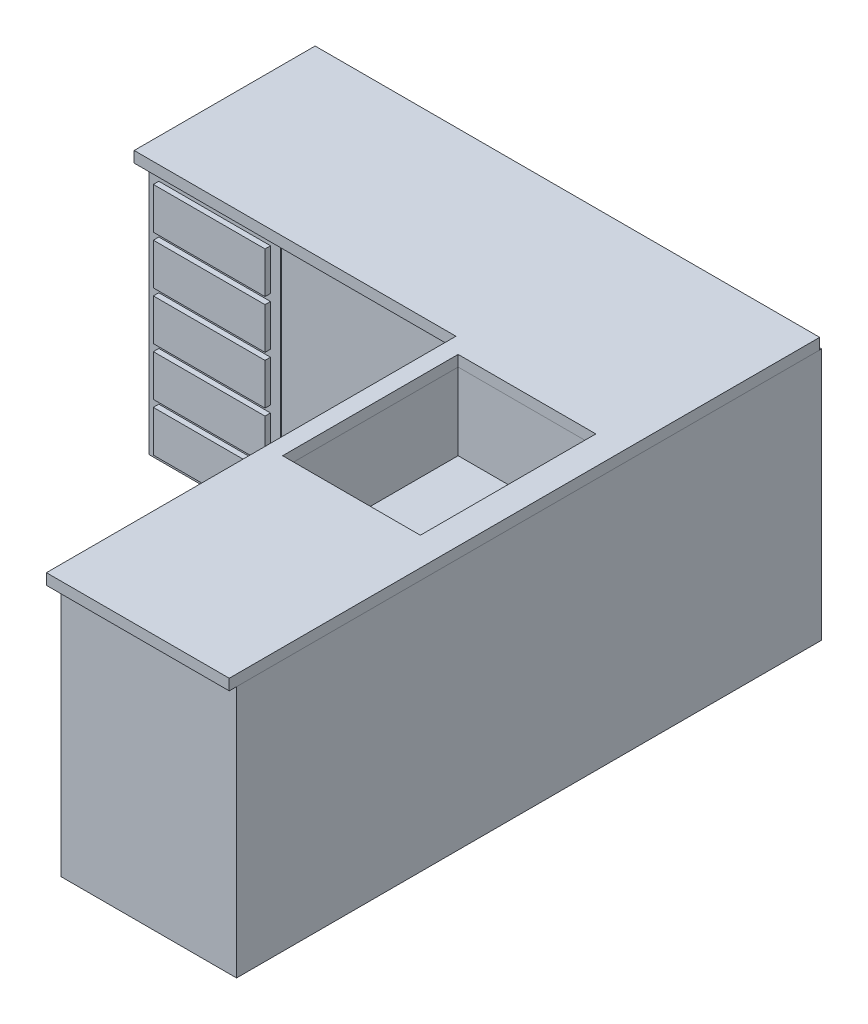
from build123d import *

# Parameters (mm, degrees)
SKETCH1_W           = 1727.2
SKETCH1_H           = 876.3
BOSS_EXTRUDE1_DEPTH = 609.6
SKETCH2_W           = 1752.6
SKETCH2_H           = 628.488095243
BOSS_EXTRUDE2_DEPTH = 38.1
SKETCH3_W           = 609.6
SKETCH3_H           = 876.3
BOSS_EXTRUDE3_DEPTH = 1422.4
SKETCH4_W           = 635
SKETCH4_H           = 38.1
BOSS_EXTRUDE4_DEPTH = 1422.4
SKETCH6_W           = 609.6
SKETCH6_H           = 876.3
CUT_EXTRUDE3_DEPTH  = 2433.17434408
SKETCH7_W           = 596.9
SKETCH7_H           = 876.3
BOSS_EXTRUDE5_DEPTH = 508
SKETCH8_W           = 387.942340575
SKETCH8_H           = 143.620327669
BOSS_EXTRUDE6_DEPTH = 19.05
LPATTERN1_COUNT     = 5
LPATTERN1_PITCH     = 167.64
SKETCH5_W           = 478.367232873
SKETCH5_H           = 609.6
CUT_EXTRUDE1_DEPTH  = 304.8
SKETCH10_W          = 607.335562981
SKETCH10_H          = 254.367596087
BOSS_EXTRUDE7_DEPTH = 19.05
LPATTERN2_COUNT     = 3
LPATTERN2_PITCH     = 266.7
SKETCH11_W          = 724.324329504
SKETCH11_H          = 154.907916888
SKETCH11_W_2        = 353.392571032
SKETCH11_H_2        = 648.685568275
BOSS_EXTRUDE8_DEPTH = 19.05


with BuildPart() as part:
    # Sketch1 → Boss-Extrude1 (new body)
    with BuildSketch(Plane.XY):
        with Locations((863.6, 438.15)):
            Rectangle(SKETCH1_W, SKETCH1_H)
    extrude(amount=-BOSS_EXTRUDE1_DEPTH)

    # Sketch3 → Boss-Extrude3 (add)
    with BuildSketch(Plane.XY):
        with Locations((1422.4, 438.15)):
            Rectangle(SKETCH3_W, SKETCH3_H)
    extrude(amount=BOSS_EXTRUDE3_DEPTH)

    # Sketch6 → Cut-Extrude3 (cut, through all)
    with BuildSketch(Plane.XY):
        with Locations((762, 438.15)):
            Rectangle(SKETCH6_W, SKETCH6_H)
    extrude(amount=-CUT_EXTRUDE3_DEPTH, mode=Mode.SUBTRACT)


with BuildPart() as body_2:
    # Sketch2 → Boss-Extrude2 (new body)
    with BuildSketch(Plane(origin=(0, 876.3, 0), x_dir=(1, 0, 0), z_dir=(0, 1, 0))):
        with Locations((850.9, 288.844047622)):
            Rectangle(SKETCH2_W, SKETCH2_H)
    extrude(amount=BOSS_EXTRUDE2_DEPTH)

    # Sketch4 → Boss-Extrude4 (add)
    with BuildSketch(Plane.XY.offset(25.4)):
        with Locations((1409.7, 895.35)):
            Rectangle(SKETCH4_W, SKETCH4_H)
    extrude(amount=BOSS_EXTRUDE4_DEPTH)


with BuildPart() as cut_extrude3_piece_1:
    # of the separate pieces the step leaves, piece 1, a body of its own (cut_extrude3_pieces)
    add(part.part.solids().sort_by_distance((1066.8, 0, 0))[0])


with BuildPart() as cut_extrude3_piece_2:
    # of the separate pieces the step leaves, piece 2, a body of its own (cut_extrude3_pieces)
    add(part.part.solids().sort_by_distance((0, 0, 0))[0])

    # Sketch8 → Boss-Extrude6 (add)
    with BuildSketch(Plane.XY):
        with Locations((228.754726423, 767.36730674)):
            Rectangle(SKETCH8_W, SKETCH8_H)
    boss_extrude6 = extrude(amount=BOSS_EXTRUDE6_DEPTH)

    # LPattern1: Boss-Extrude6 ×5
    with Locations(*[(0, -i * LPATTERN1_PITCH, 0) for i in range(1, LPATTERN1_COUNT)]):
        add(boss_extrude6)


with BuildPart() as body_4:
    # Sketch7 → Boss-Extrude5 (new body)
    with BuildSketch(Plane.XY):
        with Locations((758.825, 438.15)):
            Rectangle(SKETCH7_W, SKETCH7_H)
    extrude(amount=-BOSS_EXTRUDE5_DEPTH)


with BuildPart() as cut_extrude1_tool:
    # Sketch5 → Cut-Extrude1 (new body)
    with BuildSketch(Plane(origin=(0, 914.4, 0), x_dir=(1, 0, 0), z_dir=(0, 1, 0))):
        with Locations((1389.764581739, -381)):
            Rectangle(SKETCH5_W, SKETCH5_H)
    extrude(amount=-CUT_EXTRUDE1_DEPTH)


with BuildPart() as body_2_1:
    add(body_2.part)

    # Cut-Extrude1: cut by cut_extrude1_tool
    add(cut_extrude1_tool.part, mode=Mode.SUBTRACT)


with BuildPart() as cut_extrude3_piece_1_1:
    add(cut_extrude3_piece_1.part)

    # Cut-Extrude1: cut by cut_extrude1_tool
    add(cut_extrude1_tool.part, mode=Mode.SUBTRACT)

    # Sketch10 → Boss-Extrude7 (add)
    with BuildSketch(Plane.ZY.offset(-1117.6)):
        with Locations((1084.808374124, 706.600978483)):
            Rectangle(SKETCH10_W, SKETCH10_H)
    boss_extrude7 = extrude(amount=BOSS_EXTRUDE7_DEPTH)

    # LPattern2: Boss-Extrude7 ×3
    with Locations(*[(0, -i * LPATTERN2_PITCH, 0) for i in range(1, LPATTERN2_COUNT)]):
        add(boss_extrude7)

    # Sketch11 → Boss-Extrude8 (add)
    with BuildSketch(Plane.ZY.offset(-1117.6)):
        with Locations((381, 769.832211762)):
            Rectangle(SKETCH11_W, SKETCH11_H)
        with Locations((195.534120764, 346.969606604)):
            Rectangle(SKETCH11_W_2, SKETCH11_H_2)
        with Locations((566.465879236, 346.969606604)):
            Rectangle(SKETCH11_W_2, SKETCH11_H_2)
    extrude(amount=BOSS_EXTRUDE8_DEPTH)


solid = Compound([cut_extrude3_piece_2.part, body_4.part, body_2_1.part, cut_extrude3_piece_1_1.part])
